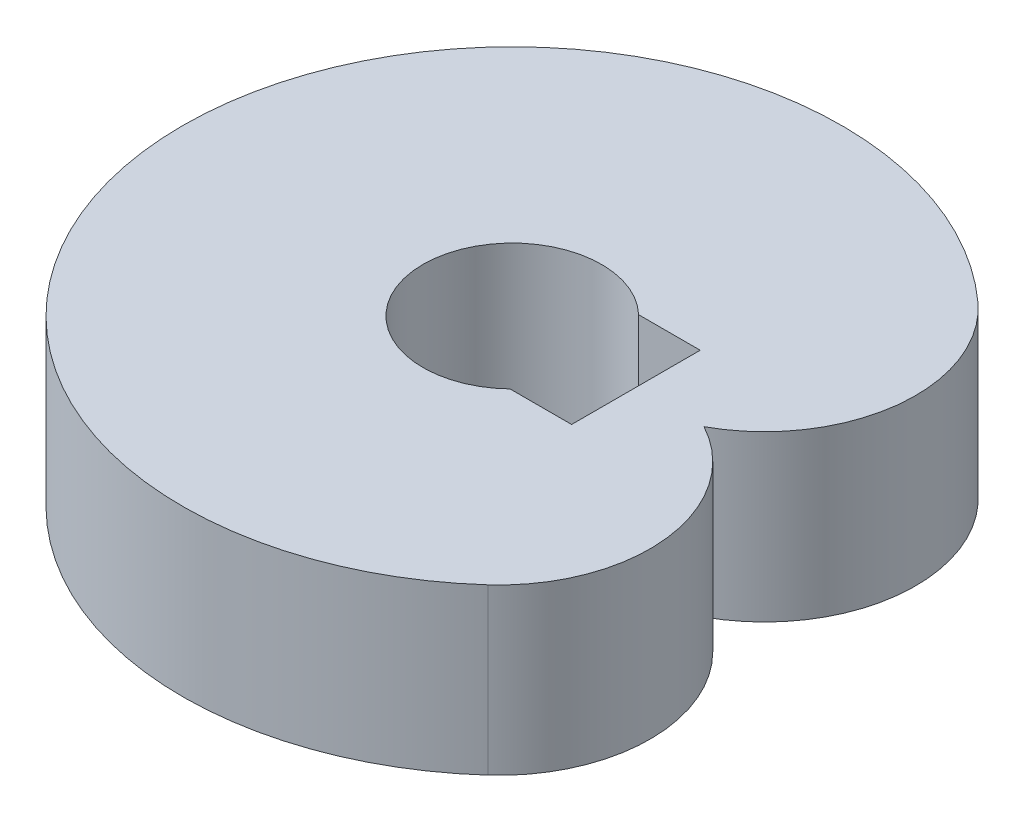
ISO-10303-21;
HEADER;
FILE_DESCRIPTION(('STEP AP214'),'2;1');
FILE_NAME('part.step','',(''),(''),'','','');
FILE_SCHEMA(('AUTOMOTIVE_DESIGN { 1 0 10303 214 1 1 1 1 }'));
ENDSEC;
DATA;
#1=APPLICATION_CONTEXT('core data for automotive mechanical design processes');
#2=APPLICATION_PROTOCOL_DEFINITION('international standard','automotive_design',2000,#1);
#3=PRODUCT_CONTEXT('',#1,'mechanical');
#4=PRODUCT('Part','Part','',(#3));
#5=PRODUCT_RELATED_PRODUCT_CATEGORY('part','',(#4));
#6=PRODUCT_DEFINITION_FORMATION('','',#4);
#7=PRODUCT_DEFINITION_CONTEXT('part definition',#1,'design');
#8=PRODUCT_DEFINITION('design','',#6,#7);
#9=PRODUCT_DEFINITION_SHAPE('','',#8);
#10=(LENGTH_UNIT() NAMED_UNIT(*) SI_UNIT(.MILLI.,.METRE.));
#11=(NAMED_UNIT(*) PLANE_ANGLE_UNIT() SI_UNIT($,.RADIAN.));
#12=(NAMED_UNIT(*) SI_UNIT($,.STERADIAN.) SOLID_ANGLE_UNIT());
#13=UNCERTAINTY_MEASURE_WITH_UNIT(LENGTH_MEASURE(1.E-05),#10,'distance_accuracy_value','');
#14=(GEOMETRIC_REPRESENTATION_CONTEXT(3) GLOBAL_UNCERTAINTY_ASSIGNED_CONTEXT((#13)) GLOBAL_UNIT_ASSIGNED_CONTEXT((#10,
#11,#12)) REPRESENTATION_CONTEXT('',''));
#15=CARTESIAN_POINT('',(0.,0.,0.));
#16=DIRECTION('',(0.,0.,1.));
#17=DIRECTION('',(1.,0.,0.));
#18=AXIS2_PLACEMENT_3D('',#15,#16,#17);
#19=CARTESIAN_POINT('',(217.46744706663,300.,241.522068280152));
#20=DIRECTION('',(0.,-1.,0.));
#21=DIRECTION('',(0.,0.,-1.));
#22=AXIS2_PLACEMENT_3D('',#19,#20,#21);
#23=CYLINDRICAL_SURFACE('',#22,275.);
#24=CARTESIAN_POINT('',(217.46744706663,0.,241.522068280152));
#25=DIRECTION('',(0.,1.,0.));
#26=DIRECTION('',(0.,0.,1.));
#27=AXIS2_PLACEMENT_3D('',#24,#25,#26);
#28=CIRCLE('',#27,275.);
#29=CARTESIAN_POINT('',(401.478363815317,0.,445.886895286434));
#30=VERTEX_POINT('',#29);
#31=CARTESIAN_POINT('',(348.966840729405,0.,-1.38777878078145E-13));
#32=VERTEX_POINT('',#31);
#33=EDGE_CURVE('E99',#30,#32,#28,.T.);
#34=ORIENTED_EDGE('',*,*,#33,.T.);
#35=DIRECTION('',(0.,-1.,0.));
#36=VECTOR('',#35,1.);
#37=CARTESIAN_POINT('',(348.966840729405,300.,-1.38777878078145E-13));
#38=LINE('',#37,#36);
#39=CARTESIAN_POINT('',(348.966840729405,300.,-1.38777878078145E-13));
#40=VERTEX_POINT('',#39);
#41=EDGE_CURVE('E11',#40,#32,#38,.T.);
#42=ORIENTED_EDGE('',*,*,#41,.F.);
#43=CARTESIAN_POINT('',(217.46744706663,300.,241.522068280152));
#44=DIRECTION('',(0.,1.,0.));
#45=DIRECTION('',(0.,0.,1.));
#46=AXIS2_PLACEMENT_3D('',#43,#44,#45);
#47=CIRCLE('',#46,275.);
#48=CARTESIAN_POINT('',(401.478363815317,300.,445.886895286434));
#49=VERTEX_POINT('',#48);
#50=EDGE_CURVE('E126',#49,#40,#47,.T.);
#51=ORIENTED_EDGE('',*,*,#50,.F.);
#52=DIRECTION('',(0.,-1.,0.));
#53=VECTOR('',#52,1.);
#54=CARTESIAN_POINT('',(401.478363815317,300.,445.886895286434));
#55=LINE('',#54,#53);
#56=EDGE_CURVE('E132',#49,#30,#55,.T.);
#57=ORIENTED_EDGE('',*,*,#56,.T.);
#58=EDGE_LOOP('',(#34,#42,#51,#57));
#59=FACE_BOUND('',#58,.T.);
#60=ADVANCED_FACE('F16',(#59),#23,.T.);
#61=CARTESIAN_POINT('',(217.46744706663,300.,-241.522068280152));
#62=DIRECTION('',(0.,-1.,0.));
#63=DIRECTION('',(0.,0.,-1.));
#64=AXIS2_PLACEMENT_3D('',#61,#62,#63);
#65=CYLINDRICAL_SURFACE('',#64,275.);
#66=CARTESIAN_POINT('',(217.46744706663,0.,-241.522068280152));
#67=DIRECTION('',(0.,1.,0.));
#68=DIRECTION('',(0.,0.,1.));
#69=AXIS2_PLACEMENT_3D('',#66,#67,#68);
#70=CIRCLE('',#69,275.);
#71=CARTESIAN_POINT('',(401.478363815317,0.,-445.886895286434));
#72=VERTEX_POINT('',#71);
#73=EDGE_CURVE('E158',#32,#72,#70,.T.);
#74=ORIENTED_EDGE('',*,*,#73,.T.);
#75=DIRECTION('',(0.,-1.,0.));
#76=VECTOR('',#75,1.);
#77=CARTESIAN_POINT('',(401.478363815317,300.,-445.886895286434));
#78=LINE('',#77,#76);
#79=CARTESIAN_POINT('',(401.478363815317,300.,-445.886895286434));
#80=VERTEX_POINT('',#79);
#81=EDGE_CURVE('E26',#80,#72,#78,.T.);
#82=ORIENTED_EDGE('',*,*,#81,.F.);
#83=CARTESIAN_POINT('',(217.46744706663,300.,-241.522068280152));
#84=DIRECTION('',(0.,1.,0.));
#85=DIRECTION('',(0.,0.,1.));
#86=AXIS2_PLACEMENT_3D('',#83,#84,#85);
#87=CIRCLE('',#86,275.);
#88=EDGE_CURVE('E146',#40,#80,#87,.T.);
#89=ORIENTED_EDGE('',*,*,#88,.F.);
#90=ORIENTED_EDGE('',*,*,#41,.T.);
#91=EDGE_LOOP('',(#74,#82,#89,#90));
#92=FACE_BOUND('',#91,.T.);
#93=ADVANCED_FACE('F274',(#92),#65,.T.);
#94=CARTESIAN_POINT('',(0.,300.,0.));
#95=DIRECTION('',(0.,-1.,0.));
#96=DIRECTION('',(0.,0.,-1.));
#97=AXIS2_PLACEMENT_3D('',#94,#95,#96);
#98=CYLINDRICAL_SURFACE('',#97,600.);
#99=CARTESIAN_POINT('',(0.,0.,0.));
#100=DIRECTION('',(0.,1.,0.));
#101=DIRECTION('',(0.,0.,1.));
#102=AXIS2_PLACEMENT_3D('',#99,#100,#101);
#103=CIRCLE('',#102,600.);
#104=EDGE_CURVE('E137',#72,#30,#103,.T.);
#105=ORIENTED_EDGE('',*,*,#104,.T.);
#106=ORIENTED_EDGE('',*,*,#56,.F.);
#107=CARTESIAN_POINT('',(0.,300.,0.));
#108=DIRECTION('',(0.,1.,0.));
#109=DIRECTION('',(0.,0.,1.));
#110=AXIS2_PLACEMENT_3D('',#107,#108,#109);
#111=CIRCLE('',#110,600.);
#112=EDGE_CURVE('E133',#80,#49,#111,.T.);
#113=ORIENTED_EDGE('',*,*,#112,.F.);
#114=ORIENTED_EDGE('',*,*,#81,.T.);
#115=EDGE_LOOP('',(#105,#106,#113,#114));
#116=FACE_BOUND('',#115,.T.);
#117=ADVANCED_FACE('F186',(#116),#98,.T.);
#118=CARTESIAN_POINT('',(0.,300.,0.));
#119=DIRECTION('',(0.,-1.,0.));
#120=DIRECTION('',(0.,0.,-1.));
#121=AXIS2_PLACEMENT_3D('',#118,#119,#120);
#122=CYLINDRICAL_SURFACE('',#121,162.6);
#123=DIRECTION('',(0.,-1.,0.));
#124=VECTOR('',#123,1.);
#125=CARTESIAN_POINT('',(112.914835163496,300.,-117.000000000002));
#126=LINE('',#125,#124);
#127=CARTESIAN_POINT('',(112.914835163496,300.,-117.000000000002));
#128=VERTEX_POINT('',#127);
#129=CARTESIAN_POINT('',(112.914835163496,0.,-117.000000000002));
#130=VERTEX_POINT('',#129);
#131=EDGE_CURVE('E129',#128,#130,#126,.T.);
#132=ORIENTED_EDGE('',*,*,#131,.F.);
#133=CARTESIAN_POINT('',(0.,300.,0.));
#134=DIRECTION('',(0.,1.,0.));
#135=DIRECTION('',(0.,0.,1.));
#136=AXIS2_PLACEMENT_3D('',#133,#134,#135);
#137=CIRCLE('',#136,162.6);
#138=CARTESIAN_POINT('',(112.914835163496,300.,117.000000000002));
#139=VERTEX_POINT('',#138);
#140=EDGE_CURVE('E94',#128,#139,#137,.T.);
#141=ORIENTED_EDGE('',*,*,#140,.T.);
#142=DIRECTION('',(0.,1.,0.));
#143=VECTOR('',#142,1.);
#144=CARTESIAN_POINT('',(112.914835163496,300.,117.000000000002));
#145=LINE('',#144,#143);
#146=CARTESIAN_POINT('',(112.914835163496,0.,117.000000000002));
#147=VERTEX_POINT('',#146);
#148=EDGE_CURVE('E138',#147,#139,#145,.T.);
#149=ORIENTED_EDGE('',*,*,#148,.F.);
#150=CARTESIAN_POINT('',(0.,0.,0.));
#151=DIRECTION('',(0.,1.,0.));
#152=DIRECTION('',(0.,0.,1.));
#153=AXIS2_PLACEMENT_3D('',#150,#151,#152);
#154=CIRCLE('',#153,162.6);
#155=EDGE_CURVE('E159',#130,#147,#154,.T.);
#156=ORIENTED_EDGE('',*,*,#155,.F.);
#157=EDGE_LOOP('',(#132,#141,#149,#156));
#158=FACE_BOUND('',#157,.T.);
#159=ADVANCED_FACE('F238',(#158),#122,.F.);
#160=CARTESIAN_POINT('',(0.,300.,0.));
#161=DIRECTION('',(0.,1.,0.));
#162=DIRECTION('',(1.,0.,0.));
#163=AXIS2_PLACEMENT_3D('',#160,#161,#162);
#164=PLANE('',#163);
#165=DIRECTION('',(-1.,0.,0.));
#166=VECTOR('',#165,1.);
#167=CARTESIAN_POINT('',(87.430047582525,300.,-117.000000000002));
#168=LINE('',#167,#166);
#169=CARTESIAN_POINT('',(225.,300.,-117.000000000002));
#170=VERTEX_POINT('',#169);
#171=EDGE_CURVE('E19',#170,#128,#168,.T.);
#172=ORIENTED_EDGE('',*,*,#171,.F.);
#173=DIRECTION('',(0.,0.,-1.));
#174=VECTOR('',#173,1.);
#175=CARTESIAN_POINT('',(225.,300.,-117.000000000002));
#176=LINE('',#175,#174);
#177=CARTESIAN_POINT('',(225.,300.,117.000000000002));
#178=VERTEX_POINT('',#177);
#179=EDGE_CURVE('E92',#178,#170,#176,.T.);
#180=ORIENTED_EDGE('',*,*,#179,.F.);
#181=DIRECTION('',(1.,0.,0.));
#182=VECTOR('',#181,1.);
#183=CARTESIAN_POINT('',(87.430047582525,300.,117.000000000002));
#184=LINE('',#183,#182);
#185=EDGE_CURVE('E142',#139,#178,#184,.T.);
#186=ORIENTED_EDGE('',*,*,#185,.F.);
#187=ORIENTED_EDGE('',*,*,#140,.F.);
#188=EDGE_LOOP('',(#172,#180,#186,#187));
#189=FACE_BOUND('',#188,.T.);
#190=ORIENTED_EDGE('',*,*,#50,.T.);
#191=ORIENTED_EDGE('',*,*,#88,.T.);
#192=ORIENTED_EDGE('',*,*,#112,.T.);
#193=EDGE_LOOP('',(#190,#191,#192));
#194=FACE_BOUND('',#193,.T.);
#195=ADVANCED_FACE('F88',(#189,#194),#164,.T.);
#196=CARTESIAN_POINT('',(0.,0.,0.));
#197=DIRECTION('',(0.,1.,0.));
#198=DIRECTION('',(1.,0.,0.));
#199=AXIS2_PLACEMENT_3D('',#196,#197,#198);
#200=PLANE('',#199);
#201=DIRECTION('',(0.,0.,-1.));
#202=VECTOR('',#201,1.);
#203=CARTESIAN_POINT('',(225.,0.,-117.000000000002));
#204=LINE('',#203,#202);
#205=CARTESIAN_POINT('',(225.,0.,117.000000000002));
#206=VERTEX_POINT('',#205);
#207=CARTESIAN_POINT('',(225.,0.,-117.000000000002));
#208=VERTEX_POINT('',#207);
#209=EDGE_CURVE('E108',#206,#208,#204,.T.);
#210=ORIENTED_EDGE('',*,*,#209,.T.);
#211=DIRECTION('',(-1.,0.,0.));
#212=VECTOR('',#211,1.);
#213=CARTESIAN_POINT('',(87.430047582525,0.,-117.000000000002));
#214=LINE('',#213,#212);
#215=EDGE_CURVE('E100',#208,#130,#214,.T.);
#216=ORIENTED_EDGE('',*,*,#215,.T.);
#217=ORIENTED_EDGE('',*,*,#155,.T.);
#218=DIRECTION('',(1.,0.,0.));
#219=VECTOR('',#218,1.);
#220=CARTESIAN_POINT('',(0.,0.,117.000000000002));
#221=LINE('',#220,#219);
#222=EDGE_CURVE('E115',#147,#206,#221,.T.);
#223=ORIENTED_EDGE('',*,*,#222,.T.);
#224=EDGE_LOOP('',(#210,#216,#217,#223));
#225=FACE_BOUND('',#224,.T.);
#226=ORIENTED_EDGE('',*,*,#33,.F.);
#227=ORIENTED_EDGE('',*,*,#104,.F.);
#228=ORIENTED_EDGE('',*,*,#73,.F.);
#229=EDGE_LOOP('',(#226,#227,#228));
#230=FACE_BOUND('',#229,.T.);
#231=ADVANCED_FACE('F230',(#225,#230),#200,.F.);
#232=CARTESIAN_POINT('',(87.430047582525,0.,-117.000000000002));
#233=DIRECTION('',(0.,0.,-1.));
#234=DIRECTION('',(0.,-1.,0.));
#235=AXIS2_PLACEMENT_3D('',#232,#233,#234);
#236=PLANE('',#235);
#237=ORIENTED_EDGE('',*,*,#131,.T.);
#238=ORIENTED_EDGE('',*,*,#215,.F.);
#239=DIRECTION('',(0.,1.,0.));
#240=VECTOR('',#239,1.);
#241=CARTESIAN_POINT('',(225.,0.,-117.000000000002));
#242=LINE('',#241,#240);
#243=EDGE_CURVE('E102',#208,#170,#242,.T.);
#244=ORIENTED_EDGE('',*,*,#243,.T.);
#245=ORIENTED_EDGE('',*,*,#171,.T.);
#246=EDGE_LOOP('',(#237,#238,#244,#245));
#247=FACE_BOUND('',#246,.T.);
#248=ADVANCED_FACE('F103',(#247),#236,.F.);
#249=CARTESIAN_POINT('',(225.,0.,-117.000000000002));
#250=DIRECTION('',(1.,0.,0.));
#251=DIRECTION('',(0.,1.,0.));
#252=AXIS2_PLACEMENT_3D('',#249,#250,#251);
#253=PLANE('',#252);
#254=ORIENTED_EDGE('',*,*,#179,.T.);
#255=ORIENTED_EDGE('',*,*,#243,.F.);
#256=ORIENTED_EDGE('',*,*,#209,.F.);
#257=DIRECTION('',(0.,1.,0.));
#258=VECTOR('',#257,1.);
#259=CARTESIAN_POINT('',(225.,0.,117.000000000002));
#260=LINE('',#259,#258);
#261=EDGE_CURVE('E112',#206,#178,#260,.T.);
#262=ORIENTED_EDGE('',*,*,#261,.T.);
#263=EDGE_LOOP('',(#254,#255,#256,#262));
#264=FACE_BOUND('',#263,.T.);
#265=ADVANCED_FACE('F110',(#264),#253,.F.);
#266=CARTESIAN_POINT('',(87.430047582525,0.,117.000000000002));
#267=DIRECTION('',(0.,0.,1.));
#268=DIRECTION('',(1.,0.,0.));
#269=AXIS2_PLACEMENT_3D('',#266,#267,#268);
#270=PLANE('',#269);
#271=ORIENTED_EDGE('',*,*,#148,.T.);
#272=ORIENTED_EDGE('',*,*,#185,.T.);
#273=ORIENTED_EDGE('',*,*,#261,.F.);
#274=ORIENTED_EDGE('',*,*,#222,.F.);
#275=EDGE_LOOP('',(#271,#272,#273,#274));
#276=FACE_BOUND('',#275,.T.);
#277=ADVANCED_FACE('F246',(#276),#270,.F.);
#278=CLOSED_SHELL('',(#60,#93,#117,#159,#195,#231,#248,#265,#277));
#279=MANIFOLD_SOLID_BREP('B1',#278);
#280=ADVANCED_BREP_SHAPE_REPRESENTATION('',(#18,#279),#14);
#281=SHAPE_DEFINITION_REPRESENTATION(#9,#280);
ENDSEC;
END-ISO-10303-21;
